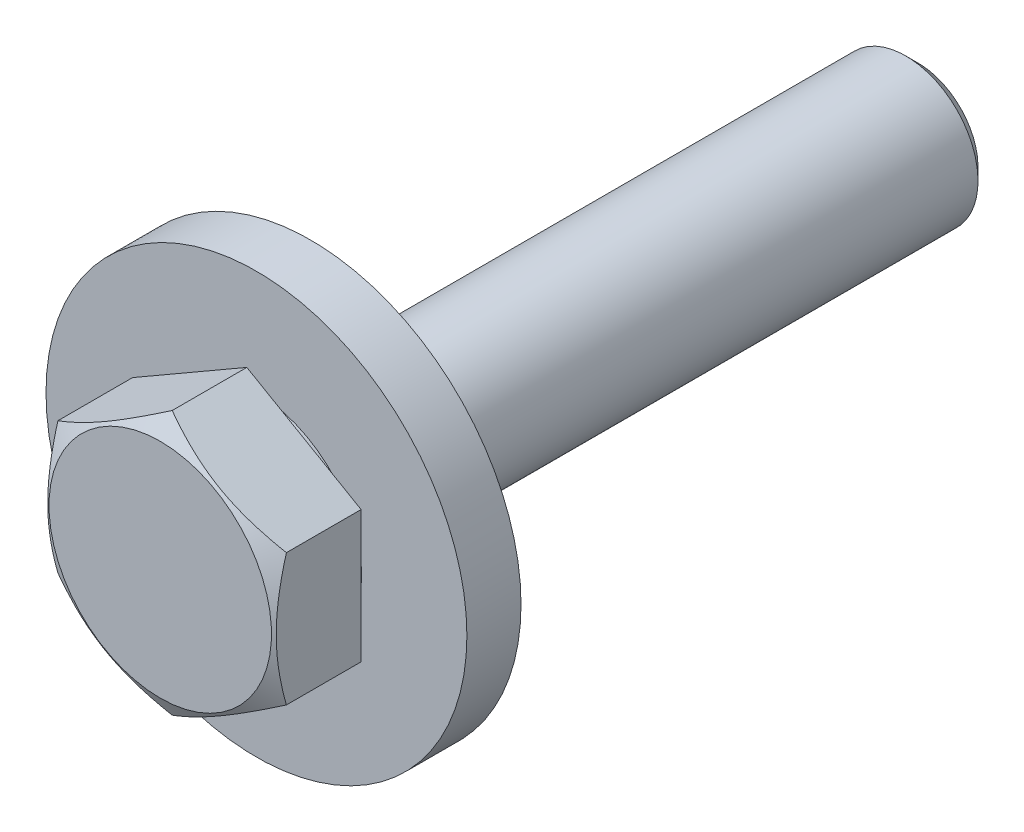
ISO-10303-21;
HEADER;
FILE_DESCRIPTION(('STEP AP214'),'2;1');
FILE_NAME('part.step','',(''),(''),'','','');
FILE_SCHEMA(('AUTOMOTIVE_DESIGN { 1 0 10303 214 1 1 1 1 }'));
ENDSEC;
DATA;
#1=APPLICATION_CONTEXT('core data for automotive mechanical design processes');
#2=APPLICATION_PROTOCOL_DEFINITION('international standard','automotive_design',2000,#1);
#3=PRODUCT_CONTEXT('',#1,'mechanical');
#4=PRODUCT('Part','Part','',(#3));
#5=PRODUCT_RELATED_PRODUCT_CATEGORY('part','',(#4));
#6=PRODUCT_DEFINITION_FORMATION('','',#4);
#7=PRODUCT_DEFINITION_CONTEXT('part definition',#1,'design');
#8=PRODUCT_DEFINITION('design','',#6,#7);
#9=PRODUCT_DEFINITION_SHAPE('','',#8);
#10=(LENGTH_UNIT() NAMED_UNIT(*) SI_UNIT(.MILLI.,.METRE.));
#11=(NAMED_UNIT(*) PLANE_ANGLE_UNIT() SI_UNIT($,.RADIAN.));
#12=(NAMED_UNIT(*) SI_UNIT($,.STERADIAN.) SOLID_ANGLE_UNIT());
#13=UNCERTAINTY_MEASURE_WITH_UNIT(LENGTH_MEASURE(1.E-05),#10,'distance_accuracy_value','');
#14=(GEOMETRIC_REPRESENTATION_CONTEXT(3) GLOBAL_UNCERTAINTY_ASSIGNED_CONTEXT((#13)) GLOBAL_UNIT_ASSIGNED_CONTEXT((#10,
#11,#12)) REPRESENTATION_CONTEXT('',''));
#15=CARTESIAN_POINT('',(0.,0.,0.));
#16=DIRECTION('',(0.,0.,1.));
#17=DIRECTION('',(1.,0.,0.));
#18=AXIS2_PLACEMENT_3D('',#15,#16,#17);
#19=CARTESIAN_POINT('',(0.,0.,4.5));
#20=DIRECTION('',(0.,0.,-1.));
#21=DIRECTION('',(-1.,0.,0.));
#22=AXIS2_PLACEMENT_3D('',#19,#20,#21);
#23=CYLINDRICAL_SURFACE('',#22,17.5);
#24=CARTESIAN_POINT('',(0.,0.,4.5));
#25=DIRECTION('',(0.,0.,1.));
#26=DIRECTION('',(1.,0.,0.));
#27=AXIS2_PLACEMENT_3D('',#24,#25,#26);
#28=CIRCLE('',#27,17.5);
#29=CARTESIAN_POINT('',(17.5,0.,4.5));
#30=VERTEX_POINT('',#29);
#31=EDGE_CURVE('E259',#30,#30,#28,.T.);
#32=ORIENTED_EDGE('',*,*,#31,.F.);
#33=EDGE_LOOP('',(#32));
#34=FACE_BOUND('',#33,.T.);
#35=CARTESIAN_POINT('',(0.,0.,0.));
#36=DIRECTION('',(0.,0.,1.));
#37=DIRECTION('',(1.,0.,0.));
#38=AXIS2_PLACEMENT_3D('',#35,#36,#37);
#39=CIRCLE('',#38,17.5);
#40=CARTESIAN_POINT('',(17.5,0.,0.));
#41=VERTEX_POINT('',#40);
#42=EDGE_CURVE('E28',#41,#41,#39,.T.);
#43=ORIENTED_EDGE('',*,*,#42,.T.);
#44=EDGE_LOOP('',(#43));
#45=FACE_BOUND('',#44,.T.);
#46=ADVANCED_FACE('F14',(#34,#45),#23,.T.);
#47=CARTESIAN_POINT('',(0.,0.,4.5));
#48=DIRECTION('',(0.,0.,-1.));
#49=DIRECTION('',(-1.,0.,0.));
#50=AXIS2_PLACEMENT_3D('',#47,#48,#49);
#51=CYLINDRICAL_SURFACE('',#50,6.5);
#52=CARTESIAN_POINT('',(0.,0.,4.5));
#53=DIRECTION('',(0.,0.,1.));
#54=DIRECTION('',(1.,0.,0.));
#55=AXIS2_PLACEMENT_3D('',#52,#53,#54);
#56=CIRCLE('',#55,6.5);
#57=CARTESIAN_POINT('',(6.5,0.,4.5));
#58=VERTEX_POINT('',#57);
#59=EDGE_CURVE('E262',#58,#58,#56,.T.);
#60=ORIENTED_EDGE('',*,*,#59,.T.);
#61=EDGE_LOOP('',(#60));
#62=FACE_BOUND('',#61,.T.);
#63=CARTESIAN_POINT('',(0.,0.,0.));
#64=DIRECTION('',(0.,0.,1.));
#65=DIRECTION('',(1.,0.,0.));
#66=AXIS2_PLACEMENT_3D('',#63,#64,#65);
#67=CIRCLE('',#66,6.5);
#68=CARTESIAN_POINT('',(6.5,0.,0.));
#69=VERTEX_POINT('',#68);
#70=EDGE_CURVE('E263',#69,#69,#67,.T.);
#71=ORIENTED_EDGE('',*,*,#70,.F.);
#72=EDGE_LOOP('',(#71));
#73=FACE_BOUND('',#72,.T.);
#74=ADVANCED_FACE('F255',(#62,#73),#51,.F.);
#75=CARTESIAN_POINT('',(0.,0.,4.5));
#76=DIRECTION('',(0.,0.,1.));
#77=DIRECTION('',(1.,0.,0.));
#78=AXIS2_PLACEMENT_3D('',#75,#76,#77);
#79=PLANE('',#78);
#80=CARTESIAN_POINT('',(0.,0.,4.5));
#81=DIRECTION('',(0.,0.,1.));
#82=DIRECTION('',(1.,0.,0.));
#83=AXIS2_PLACEMENT_3D('',#80,#81,#82);
#84=CIRCLE('',#83,8.75);
#85=CARTESIAN_POINT('',(8.75,0.,4.5));
#86=VERTEX_POINT('',#85);
#87=EDGE_CURVE('E9',#86,#86,#84,.T.);
#88=ORIENTED_EDGE('',*,*,#87,.F.);
#89=EDGE_LOOP('',(#88));
#90=FACE_BOUND('',#89,.T.);
#91=ORIENTED_EDGE('',*,*,#31,.T.);
#92=EDGE_LOOP('',(#91));
#93=FACE_BOUND('',#92,.T.);
#94=ADVANCED_FACE('F252',(#90,#93),#79,.T.);
#95=CARTESIAN_POINT('',(0.,0.,0.));
#96=DIRECTION('',(0.,0.,1.));
#97=DIRECTION('',(1.,0.,0.));
#98=AXIS2_PLACEMENT_3D('',#95,#96,#97);
#99=PLANE('',#98);
#100=ORIENTED_EDGE('',*,*,#42,.F.);
#101=EDGE_LOOP('',(#100));
#102=FACE_BOUND('',#101,.T.);
#103=ORIENTED_EDGE('',*,*,#70,.T.);
#104=EDGE_LOOP('',(#103));
#105=FACE_BOUND('',#104,.T.);
#106=ADVANCED_FACE('F141',(#102,#105),#99,.F.);
#107=CARTESIAN_POINT('',(8.01073498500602,-4.625,12.5));
#108=DIRECTION('',(0.,0.,1.));
#109=DIRECTION('',(0.5,0.86602540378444,0.));
#110=AXIS2_PLACEMENT_3D('',#107,#108,#109);
#111=PLANE('',#110);
#112=CARTESIAN_POINT('',(0.,0.,12.5));
#113=DIRECTION('',(0.,0.,-1.));
#114=DIRECTION('',(-0.86602540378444,0.5,0.));
#115=AXIS2_PLACEMENT_3D('',#112,#113,#114);
#116=CIRCLE('',#115,9.25);
#117=CARTESIAN_POINT('',(-8.01073498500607,4.625,12.5));
#118=VERTEX_POINT('',#117);
#119=EDGE_CURVE('E120',#118,#118,#116,.T.);
#120=ORIENTED_EDGE('',*,*,#119,.F.);
#121=EDGE_LOOP('',(#120));
#122=FACE_BOUND('',#121,.T.);
#123=ADVANCED_FACE('F136',(#122),#111,.T.);
#124=CARTESIAN_POINT('',(0.,0.,11.4896370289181));
#125=DIRECTION('',(0.,0.,-1.));
#126=DIRECTION('',(-0.86602540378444,0.5,0.));
#127=AXIS2_PLACEMENT_3D('',#124,#125,#126);
#128=CONICAL_SURFACE('',#127,11.,1.04719755);
#129=CARTESIAN_POINT('',(0.,-10.9696551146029,11.5071566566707));
#130=CARTESIAN_POINT('',(-2.54432596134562,-9.50068783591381,12.3552653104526));
#131=CARTESIAN_POINT('',(-4.74858786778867,-8.22805663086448,12.3556623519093));
#132=CARTESIAN_POINT('',(-6.95329155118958,-6.95517036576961,12.3560594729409));
#133=CARTESIAN_POINT('',(-9.50000000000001,-5.48482755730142,11.5071566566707));
#134=B_SPLINE_CURVE_WITH_KNOTS('',2,(#129,#130,#131,#132,#133),.UNSPECIFIED.,.F.,.F.,(3,2,3),
(0.,0.5,1.),.UNSPECIFIED.);
#135=CARTESIAN_POINT('',(0.,-10.9696551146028,11.5071566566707));
#136=VERTEX_POINT('',#135);
#137=CARTESIAN_POINT('',(-9.5,-5.48482755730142,11.5071566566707));
#138=VERTEX_POINT('',#137);
#139=EDGE_CURVE('E312',#136,#138,#134,.T.);
#140=ORIENTED_EDGE('',*,*,#139,.F.);
#141=CARTESIAN_POINT('',(9.49999999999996,-5.48482755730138,11.5071566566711));
#142=CARTESIAN_POINT('',(6.95962939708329,-6.95151120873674,12.3539468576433));
#143=CARTESIAN_POINT('',(4.75907682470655,-8.22200082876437,12.3556590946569));
#144=CARTESIAN_POINT('',(2.55066237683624,-9.49702950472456,12.3573774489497));
#145=CARTESIAN_POINT('',(0.,-10.9696551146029,11.5071566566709));
#146=B_SPLINE_CURVE_WITH_KNOTS('',2,(#141,#142,#143,#144,#145),.UNSPECIFIED.,.F.,.F.,(3,2,3),
(0.,0.5,1.),.UNSPECIFIED.);
#147=CARTESIAN_POINT('',(9.5,-5.48482755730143,11.5071566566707));
#148=VERTEX_POINT('',#147);
#149=EDGE_CURVE('E170',#148,#136,#146,.T.);
#150=ORIENTED_EDGE('',*,*,#149,.F.);
#151=CARTESIAN_POINT('',(9.49999999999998,5.48482755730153,11.507156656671));
#152=CARTESIAN_POINT('',(9.49999999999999,2.55146025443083,12.3539468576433));
#153=CARTESIAN_POINT('',(9.49999999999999,0.01048101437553,12.3556590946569));
#154=CARTESIAN_POINT('',(9.5,-2.53957633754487,12.3573774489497));
#155=CARTESIAN_POINT('',(9.5,-5.48482755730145,11.5071566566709));
#156=B_SPLINE_CURVE_WITH_KNOTS('',2,(#151,#152,#153,#154,#155),.UNSPECIFIED.,.F.,.F.,(3,2,3),
(0.,0.5,1.),.UNSPECIFIED.);
#157=CARTESIAN_POINT('',(9.5,5.48482755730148,11.5071566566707));
#158=VERTEX_POINT('',#157);
#159=EDGE_CURVE('E82',#158,#148,#156,.T.);
#160=ORIENTED_EDGE('',*,*,#159,.F.);
#161=CARTESIAN_POINT('',(0.,10.9696551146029,11.5071566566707));
#162=CARTESIAN_POINT('',(2.54584212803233,9.49981247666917,12.3557706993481));
#163=CARTESIAN_POINT('',(4.75141213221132,8.22642604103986,12.3556623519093));
#164=CARTESIAN_POINT('',(6.95480763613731,6.95429505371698,12.3555541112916));
#165=CARTESIAN_POINT('',(9.5,5.48482755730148,11.5071566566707));
#166=B_SPLINE_CURVE_WITH_KNOTS('',2,(#161,#162,#163,#164,#165),.UNSPECIFIED.,.F.,.F.,(3,2,3),
(0.,0.5,1.),.UNSPECIFIED.);
#167=CARTESIAN_POINT('',(0.,10.9696551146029,11.5071566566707));
#168=VERTEX_POINT('',#167);
#169=EDGE_CURVE('E89',#168,#158,#166,.T.);
#170=ORIENTED_EDGE('',*,*,#169,.F.);
#171=CARTESIAN_POINT('',(-9.50000000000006,5.48482755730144,11.507156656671));
#172=CARTESIAN_POINT('',(-6.95962939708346,6.95151120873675,12.3539468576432));
#173=CARTESIAN_POINT('',(-4.75907682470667,8.22200082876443,12.3556590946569));
#174=CARTESIAN_POINT('',(-2.55066237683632,9.49702950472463,12.3573774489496));
#175=CARTESIAN_POINT('',(0.,10.9696551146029,11.5071566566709));
#176=B_SPLINE_CURVE_WITH_KNOTS('',2,(#171,#172,#173,#174,#175),.UNSPECIFIED.,.F.,.F.,(3,2,3),
(0.,0.5,1.),.UNSPECIFIED.);
#177=CARTESIAN_POINT('',(-9.5,5.48482755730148,11.5071566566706));
#178=VERTEX_POINT('',#177);
#179=EDGE_CURVE('E95',#178,#168,#176,.T.);
#180=ORIENTED_EDGE('',*,*,#179,.F.);
#181=CARTESIAN_POINT('',(-9.49999999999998,-5.48482755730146,11.507156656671));
#182=CARTESIAN_POINT('',(-9.49999999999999,-2.55146025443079,12.3539468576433));
#183=CARTESIAN_POINT('',(-9.49999999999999,-0.0104810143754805,12.3556590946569));
#184=CARTESIAN_POINT('',(-9.5,2.53957633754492,12.3573774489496));
#185=CARTESIAN_POINT('',(-9.5,5.4848275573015,11.5071566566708));
#186=B_SPLINE_CURVE_WITH_KNOTS('',2,(#181,#182,#183,#184,#185),.UNSPECIFIED.,.F.,.F.,(3,2,3),
(0.,0.5,1.),.UNSPECIFIED.);
#187=EDGE_CURVE('E101',#138,#178,#186,.T.);
#188=ORIENTED_EDGE('',*,*,#187,.F.);
#189=EDGE_LOOP('',(#140,#150,#160,#170,#180,#188));
#190=FACE_BOUND('',#189,.T.);
#191=ORIENTED_EDGE('',*,*,#119,.T.);
#192=EDGE_LOOP('',(#191));
#193=FACE_BOUND('',#192,.T.);
#194=ADVANCED_FACE('F98',(#190,#193),#128,.T.);
#195=CARTESIAN_POINT('',(0.,-10.9696551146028,12.5));
#196=DIRECTION('',(-0.5,0.866025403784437,0.));
#197=DIRECTION('',(0.,0.,1.));
#198=AXIS2_PLACEMENT_3D('',#195,#196,#197);
#199=PLANE('',#198);
#200=DIRECTION('',(0.866025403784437,0.5,0.));
#201=VECTOR('',#200,1.);
#202=CARTESIAN_POINT('',(8.53886114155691,-6.03974133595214,5.3));
#203=LINE('',#202,#201);
#204=CARTESIAN_POINT('',(0.,-10.9696551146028,5.3));
#205=VERTEX_POINT('',#204);
#206=CARTESIAN_POINT('',(9.5,-5.48482755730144,5.3));
#207=VERTEX_POINT('',#206);
#208=EDGE_CURVE('E308',#205,#207,#203,.T.);
#209=ORIENTED_EDGE('',*,*,#208,.T.);
#210=DIRECTION('',(0.,0.,1.));
#211=VECTOR('',#210,1.);
#212=CARTESIAN_POINT('',(9.5,-5.48482755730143,12.5));
#213=LINE('',#212,#211);
#214=EDGE_CURVE('E175',#207,#148,#213,.T.);
#215=ORIENTED_EDGE('',*,*,#214,.T.);
#216=ORIENTED_EDGE('',*,*,#149,.T.);
#217=DIRECTION('',(0.,0.,1.));
#218=VECTOR('',#217,1.);
#219=CARTESIAN_POINT('',(0.,-10.9696551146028,12.5));
#220=LINE('',#219,#218);
#221=EDGE_CURVE('E307',#205,#136,#220,.T.);
#222=ORIENTED_EDGE('',*,*,#221,.F.);
#223=EDGE_LOOP('',(#209,#215,#216,#222));
#224=FACE_BOUND('',#223,.T.);
#225=ADVANCED_FACE('F150',(#224),#199,.F.);
#226=CARTESIAN_POINT('',(9.5,-5.48482755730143,12.5));
#227=DIRECTION('',(-1.,0.,0.));
#228=DIRECTION('',(0.,-1.,0.));
#229=AXIS2_PLACEMENT_3D('',#226,#227,#228);
#230=PLANE('',#229);
#231=DIRECTION('',(0.,1.,0.));
#232=VECTOR('',#231,1.);
#233=CARTESIAN_POINT('',(9.5,-4.375,5.3));
#234=LINE('',#233,#232);
#235=CARTESIAN_POINT('',(9.5,5.48482755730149,5.3));
#236=VERTEX_POINT('',#235);
#237=EDGE_CURVE('E287',#207,#236,#234,.T.);
#238=ORIENTED_EDGE('',*,*,#237,.T.);
#239=DIRECTION('',(0.,0.,1.));
#240=VECTOR('',#239,1.);
#241=CARTESIAN_POINT('',(9.5,5.48482755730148,12.5));
#242=LINE('',#241,#240);
#243=EDGE_CURVE('E291',#236,#158,#242,.T.);
#244=ORIENTED_EDGE('',*,*,#243,.T.);
#245=ORIENTED_EDGE('',*,*,#159,.T.);
#246=ORIENTED_EDGE('',*,*,#214,.F.);
#247=EDGE_LOOP('',(#238,#244,#245,#246));
#248=FACE_BOUND('',#247,.T.);
#249=ADVANCED_FACE('F154',(#248),#230,.F.);
#250=CARTESIAN_POINT('',(9.5,5.48482755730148,12.5));
#251=DIRECTION('',(-0.5,-0.866025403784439,0.));
#252=DIRECTION('',(-0.866025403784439,0.5,0.));
#253=AXIS2_PLACEMENT_3D('',#250,#251,#252);
#254=PLANE('',#253);
#255=DIRECTION('',(-0.866025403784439,0.5,0.));
#256=VECTOR('',#255,1.);
#257=CARTESIAN_POINT('',(12.3277222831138,3.85224133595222,5.3));
#258=LINE('',#257,#256);
#259=CARTESIAN_POINT('',(0.,10.9696551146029,5.3));
#260=VERTEX_POINT('',#259);
#261=EDGE_CURVE('E222',#236,#260,#258,.T.);
#262=ORIENTED_EDGE('',*,*,#261,.T.);
#263=DIRECTION('',(0.,0.,1.));
#264=VECTOR('',#263,1.);
#265=CARTESIAN_POINT('',(0.,10.9696551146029,12.5));
#266=LINE('',#265,#264);
#267=EDGE_CURVE('E214',#260,#168,#266,.T.);
#268=ORIENTED_EDGE('',*,*,#267,.T.);
#269=ORIENTED_EDGE('',*,*,#169,.T.);
#270=ORIENTED_EDGE('',*,*,#243,.F.);
#271=EDGE_LOOP('',(#262,#268,#269,#270));
#272=FACE_BOUND('',#271,.T.);
#273=ADVANCED_FACE('F186',(#272),#254,.F.);
#274=CARTESIAN_POINT('',(0.,10.9696551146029,12.5));
#275=DIRECTION('',(0.5,-0.866025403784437,0.));
#276=DIRECTION('',(0.,0.,1.));
#277=AXIS2_PLACEMENT_3D('',#274,#275,#276);
#278=PLANE('',#277);
#279=DIRECTION('',(-0.866025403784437,-0.5,0.));
#280=VECTOR('',#279,1.);
#281=CARTESIAN_POINT('',(-0.961138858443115,10.4147413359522,5.3));
#282=LINE('',#281,#280);
#283=CARTESIAN_POINT('',(-9.5,5.48482755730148,5.3));
#284=VERTEX_POINT('',#283);
#285=EDGE_CURVE('E111',#260,#284,#282,.T.);
#286=ORIENTED_EDGE('',*,*,#285,.T.);
#287=DIRECTION('',(0.,0.,1.));
#288=VECTOR('',#287,1.);
#289=CARTESIAN_POINT('',(-9.5,5.48482755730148,12.5));
#290=LINE('',#289,#288);
#291=EDGE_CURVE('E106',#284,#178,#290,.T.);
#292=ORIENTED_EDGE('',*,*,#291,.T.);
#293=ORIENTED_EDGE('',*,*,#179,.T.);
#294=ORIENTED_EDGE('',*,*,#267,.F.);
#295=EDGE_LOOP('',(#286,#292,#293,#294));
#296=FACE_BOUND('',#295,.T.);
#297=ADVANCED_FACE('F110',(#296),#278,.F.);
#298=CARTESIAN_POINT('',(-9.5,5.48482755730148,12.5));
#299=DIRECTION('',(1.,0.,0.));
#300=DIRECTION('',(0.,0.,-1.));
#301=AXIS2_PLACEMENT_3D('',#298,#299,#300);
#302=PLANE('',#301);
#303=DIRECTION('',(0.,-1.,0.));
#304=VECTOR('',#303,1.);
#305=CARTESIAN_POINT('',(-9.5,-4.375,5.3));
#306=LINE('',#305,#304);
#307=CARTESIAN_POINT('',(-9.5,-5.48482755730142,5.3));
#308=VERTEX_POINT('',#307);
#309=EDGE_CURVE('E42',#284,#308,#306,.T.);
#310=ORIENTED_EDGE('',*,*,#309,.T.);
#311=DIRECTION('',(0.,0.,1.));
#312=VECTOR('',#311,1.);
#313=CARTESIAN_POINT('',(-9.5,-5.48482755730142,12.5));
#314=LINE('',#313,#312);
#315=EDGE_CURVE('E117',#308,#138,#314,.T.);
#316=ORIENTED_EDGE('',*,*,#315,.T.);
#317=ORIENTED_EDGE('',*,*,#187,.T.);
#318=ORIENTED_EDGE('',*,*,#291,.F.);
#319=EDGE_LOOP('',(#310,#316,#317,#318));
#320=FACE_BOUND('',#319,.T.);
#321=ADVANCED_FACE('F115',(#320),#302,.F.);
#322=CARTESIAN_POINT('',(-9.5,-5.48482755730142,12.5));
#323=DIRECTION('',(0.5,0.866025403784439,0.));
#324=DIRECTION('',(0.,0.,-1.));
#325=AXIS2_PLACEMENT_3D('',#322,#323,#324);
#326=PLANE('',#325);
#327=DIRECTION('',(0.866025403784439,-0.5,0.));
#328=VECTOR('',#327,1.);
#329=CARTESIAN_POINT('',(2.82772228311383,-12.6022413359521,5.3));
#330=LINE('',#329,#328);
#331=EDGE_CURVE('E282',#308,#205,#330,.T.);
#332=ORIENTED_EDGE('',*,*,#331,.T.);
#333=ORIENTED_EDGE('',*,*,#221,.T.);
#334=ORIENTED_EDGE('',*,*,#139,.T.);
#335=ORIENTED_EDGE('',*,*,#315,.F.);
#336=EDGE_LOOP('',(#332,#333,#334,#335));
#337=FACE_BOUND('',#336,.T.);
#338=ADVANCED_FACE('F16',(#337),#326,.F.);
#339=CARTESIAN_POINT('',(7.5777222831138,-4.375,5.3));
#340=DIRECTION('',(0.,0.,-1.));
#341=DIRECTION('',(0.5,0.86602540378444,0.));
#342=AXIS2_PLACEMENT_3D('',#339,#340,#341);
#343=PLANE('',#342);
#344=ORIENTED_EDGE('',*,*,#331,.F.);
#345=ORIENTED_EDGE('',*,*,#309,.F.);
#346=ORIENTED_EDGE('',*,*,#285,.F.);
#347=ORIENTED_EDGE('',*,*,#261,.F.);
#348=ORIENTED_EDGE('',*,*,#237,.F.);
#349=ORIENTED_EDGE('',*,*,#208,.F.);
#350=EDGE_LOOP('',(#344,#345,#346,#347,#348,#349));
#351=FACE_BOUND('',#350,.T.);
#352=CARTESIAN_POINT('',(0.,0.,5.3));
#353=DIRECTION('',(0.,0.,-1.));
#354=DIRECTION('',(-0.86602540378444,0.5,0.));
#355=AXIS2_PLACEMENT_3D('',#352,#353,#354);
#356=CIRCLE('',#355,8.75);
#357=CARTESIAN_POINT('',(-7.57772228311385,4.375,5.3));
#358=VERTEX_POINT('',#357);
#359=EDGE_CURVE('E249',#358,#358,#356,.T.);
#360=ORIENTED_EDGE('',*,*,#359,.F.);
#361=EDGE_LOOP('',(#360));
#362=FACE_BOUND('',#361,.T.);
#363=ADVANCED_FACE('F239',(#351,#362),#343,.T.);
#364=CARTESIAN_POINT('',(0.,0.,12.5));
#365=DIRECTION('',(0.,0.,-1.));
#366=DIRECTION('',(-0.86602540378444,0.5,0.));
#367=AXIS2_PLACEMENT_3D('',#364,#365,#366);
#368=CYLINDRICAL_SURFACE('',#367,8.75);
#369=ORIENTED_EDGE('',*,*,#359,.T.);
#370=EDGE_LOOP('',(#369));
#371=FACE_BOUND('',#370,.T.);
#372=ORIENTED_EDGE('',*,*,#87,.T.);
#373=EDGE_LOOP('',(#372));
#374=FACE_BOUND('',#373,.T.);
#375=ADVANCED_FACE('F137',(#371,#374),#368,.T.);
#376=CARTESIAN_POINT('',(0.,0.,-50.5));
#377=DIRECTION('',(0.,0.,-1.));
#378=DIRECTION('',(0.5,0.86602540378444,0.));
#379=AXIS2_PLACEMENT_3D('',#376,#377,#378);
#380=PLANE('',#379);
#381=CARTESIAN_POINT('',(0.,0.,-50.5));
#382=DIRECTION('',(0.,0.,-1.));
#383=DIRECTION('',(-0.86602540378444,0.5,0.));
#384=AXIS2_PLACEMENT_3D('',#381,#382,#383);
#385=CIRCLE('',#384,5.);
#386=CARTESIAN_POINT('',(-4.3301270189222,2.5,-50.5));
#387=VERTEX_POINT('',#386);
#388=EDGE_CURVE('E272',#387,#387,#385,.T.);
#389=ORIENTED_EDGE('',*,*,#388,.T.);
#390=EDGE_LOOP('',(#389));
#391=FACE_BOUND('',#390,.T.);
#392=ADVANCED_FACE('F143',(#391),#380,.T.);
#393=CARTESIAN_POINT('',(0.,0.,-50.5));
#394=DIRECTION('',(0.,0.,1.));
#395=DIRECTION('',(0.86602540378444,-0.5,0.));
#396=AXIS2_PLACEMENT_3D('',#393,#394,#395);
#397=CONICAL_SURFACE('',#396,5.,0.785398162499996);
#398=CARTESIAN_POINT('',(0.,0.,-49.5));
#399=DIRECTION('',(0.,0.,1.));
#400=DIRECTION('',(-0.86602540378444,0.5,0.));
#401=AXIS2_PLACEMENT_3D('',#398,#399,#400);
#402=CIRCLE('',#401,6.);
#403=CARTESIAN_POINT('',(-5.19615242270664,3.,-49.5));
#404=VERTEX_POINT('',#403);
#405=EDGE_CURVE('E286',#404,#404,#402,.T.);
#406=ORIENTED_EDGE('',*,*,#405,.F.);
#407=EDGE_LOOP('',(#406));
#408=FACE_BOUND('',#407,.T.);
#409=ORIENTED_EDGE('',*,*,#388,.F.);
#410=EDGE_LOOP('',(#409));
#411=FACE_BOUND('',#410,.T.);
#412=ADVANCED_FACE('F146',(#408,#411),#397,.T.);
#413=CARTESIAN_POINT('',(0.,0.,12.5));
#414=DIRECTION('',(0.,0.,-1.));
#415=DIRECTION('',(-0.86602540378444,0.5,0.));
#416=AXIS2_PLACEMENT_3D('',#413,#414,#415);
#417=CYLINDRICAL_SURFACE('',#416,6.);
#418=ORIENTED_EDGE('',*,*,#405,.T.);
#419=EDGE_LOOP('',(#418));
#420=FACE_BOUND('',#419,.T.);
#421=CARTESIAN_POINT('',(0.,0.,4.5));
#422=DIRECTION('',(0.,0.,-1.));
#423=DIRECTION('',(-0.86602540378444,0.5,0.));
#424=AXIS2_PLACEMENT_3D('',#421,#422,#423);
#425=CIRCLE('',#424,6.);
#426=CARTESIAN_POINT('',(-5.19615242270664,3.,4.5));
#427=VERTEX_POINT('',#426);
#428=EDGE_CURVE('E281',#427,#427,#425,.T.);
#429=ORIENTED_EDGE('',*,*,#428,.T.);
#430=EDGE_LOOP('',(#429));
#431=FACE_BOUND('',#430,.T.);
#432=ADVANCED_FACE('F149',(#420,#431),#417,.T.);
#433=CARTESIAN_POINT('',(5.19615242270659,-3.,4.5));
#434=DIRECTION('',(0.,0.,-1.));
#435=DIRECTION('',(0.5,0.86602540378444,0.));
#436=AXIS2_PLACEMENT_3D('',#433,#434,#435);
#437=PLANE('',#436);
#438=ORIENTED_EDGE('',*,*,#428,.F.);
#439=EDGE_LOOP('',(#438));
#440=FACE_BOUND('',#439,.T.);
#441=ORIENTED_EDGE('',*,*,#59,.F.);
#442=EDGE_LOOP('',(#441));
#443=FACE_BOUND('',#442,.T.);
#444=ADVANCED_FACE('F148',(#440,#443),#437,.T.);
#445=CLOSED_SHELL('',(#46,#74,#94,#106,#123,#194,#225,#249,#273,#297,#321,#338,#363,#375,#392,
#412,#432,#444));
#446=MANIFOLD_SOLID_BREP('B1',#445);
#447=ADVANCED_BREP_SHAPE_REPRESENTATION('',(#18,#446),#14);
#448=SHAPE_DEFINITION_REPRESENTATION(#9,#447);
ENDSEC;
END-ISO-10303-21;
